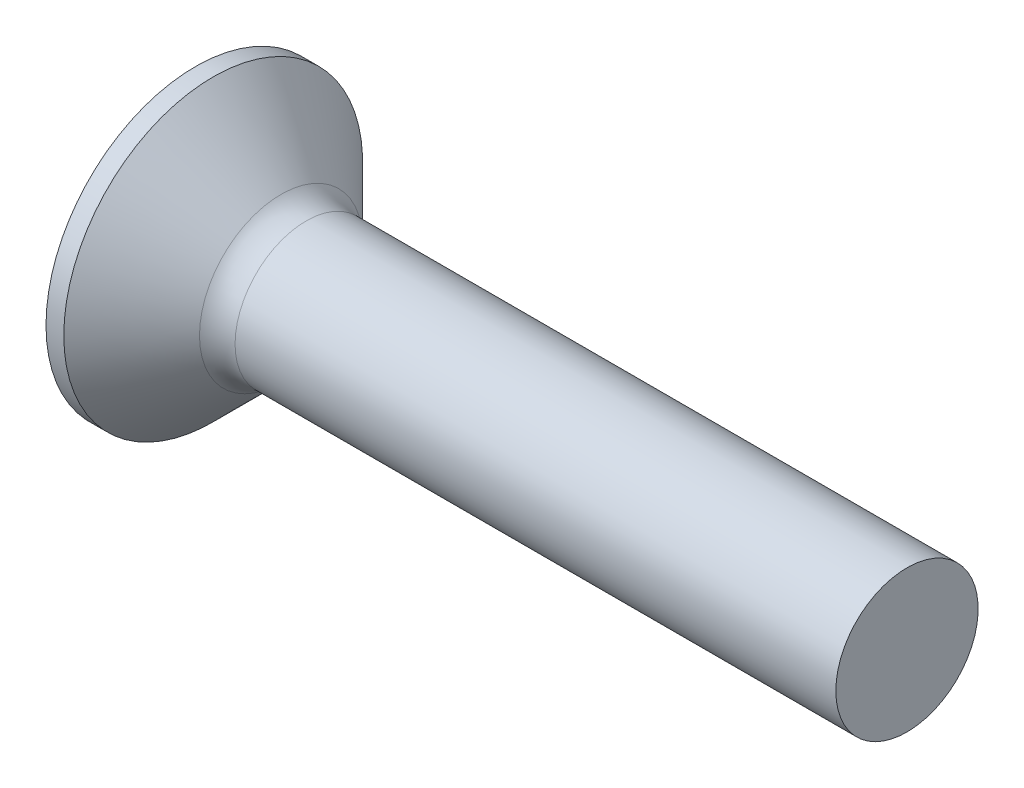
from build123d import *

# Parameters (mm, degrees)
FILLET1_R    = 1
RECPAT_COUNT = 2
RECPAT_ANGLE = 90


with BuildPart() as part:
    # BodySke → Base-Revolve (revolve)
    with BuildSketch(Plane.XY, mode=Mode.PRIVATE) as base_revolve_sk:
        Polygon((0, 0), (0, 4.2), (0.5, 4.2), (2.7, 2), (20, 2), (20, 0), align=None)
    revolve(base_revolve_sk.sketch.rotate(Axis((-6.35, 0, 0), (1, 0, 0)), 90), axis=Axis((-6.35, 0, 0), (1, 0, 0)))

    # Fillet1
    fillet1_edges = [part.edges().sort_by_distance(p)[0] for p in [
        (2.7, 0, -2),
    ]]
    fillet(fillet1_edges, radius=FILLET1_R)

    # Sketch3 → Recess section 0
    with BuildSketch(Plane.ZY):
        with BuildLine():
            Line((-0.515, 2.2), (0.515, 2.2))
            Line((0.515, 2.2), (0.515, -2.2))
            Line((0.515, -2.2), (-0.515, -2.2))
            Line((-0.515, -2.2), (-0.515, 2.2))
        make_face()
    # Sketch4 → Recess section 1
    with BuildSketch(Plane.ZY.offset(-2.51)):
        with BuildLine():
            Line((-0.515, 0.948560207), (0.515, 0.948560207))
            Line((0.515, 0.948560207), (0.515, -0.948560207))
            Line((0.515, -0.948560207), (-0.515, -0.948560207))
            Line((-0.515, -0.948560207), (-0.515, 0.948560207))
        make_face()
    recess = loft(mode=Mode.SUBTRACT)

    # RecPat: Recess ×2 about axis
    recpat_axis = Axis((0, 0, 0), (1, 0, 0))
    for i in range(1, RECPAT_COUNT):
        add(recess.rotate(recpat_axis, i * RECPAT_ANGLE / (RECPAT_COUNT - 1)), mode=Mode.SUBTRACT)

    # RecCorSke → RecessCore (revolve, cut)
    with BuildSketch(Plane.XY, mode=Mode.PRIVATE) as recesscore_sk:
        Polygon((0, 0), (0, 1.026516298), (2.51, 0.851), (2.786506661, 0), align=None)
    revolve(recesscore_sk.sketch.rotate(Axis((-3.175, 0, 0), (1, 0, 0)), 90), axis=Axis((-3.175, 0, 0), (1, 0, 0)), mode=Mode.SUBTRACT)


solid = part.part
